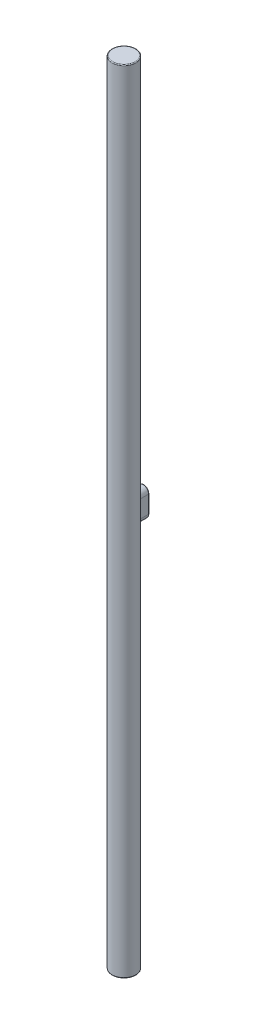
from build123d import *

# Parameters (mm, degrees)
CROQUIS1_R              = 15
SALIENTE_EXTRUIR1_DEPTH = 500
REDONDEO1_R             = 1
SALIENTE_EXTRUIR2_DEPTH = 25
REDONDEO2_R             = 1


with BuildPart() as part:
    # Croquis1 → Saliente-Extruir1 (new, symmetric)
    with BuildSketch(Plane(origin=(0, 0, 0), x_dir=(1, 0, 0), z_dir=(0, 1, 0))):
        with Locations(Location((0, 0, 0), (0, 0, 270))):
            Circle(CROQUIS1_R)
    extrude(amount=SALIENTE_EXTRUIR1_DEPTH, both=True)

    # Redondeo1
    redondeo1_edges = [part.edges().sort_by_distance(p)[0] for p in [
        (0, -500, -15),
        (0, 500, -15),
    ]]
    fillet(redondeo1_edges, radius=REDONDEO1_R)

    # Croquis2 → Saliente-Extruir2 (add)
    with BuildSketch(Plane.XY):
        with BuildLine():
            Line((-7, -11), (-7, 11))
            ThreePointArc((-7, 11), (0, 18), (7, 11))
            Line((7, 11), (7, -11))
            ThreePointArc((7, -11), (0, -18), (-7, -11))
        make_face()
    extrude(amount=-SALIENTE_EXTRUIR2_DEPTH)

    # Redondeo2
    redondeo2_edges = [part.edges().sort_by_distance(p)[0] for p in [
        (0, -18, -25),
        (-7, 0, -25),
        (0, 18, -25),
        (7, 0, -25),
    ]]
    fillet(redondeo2_edges, radius=REDONDEO2_R)


solid = part.part
